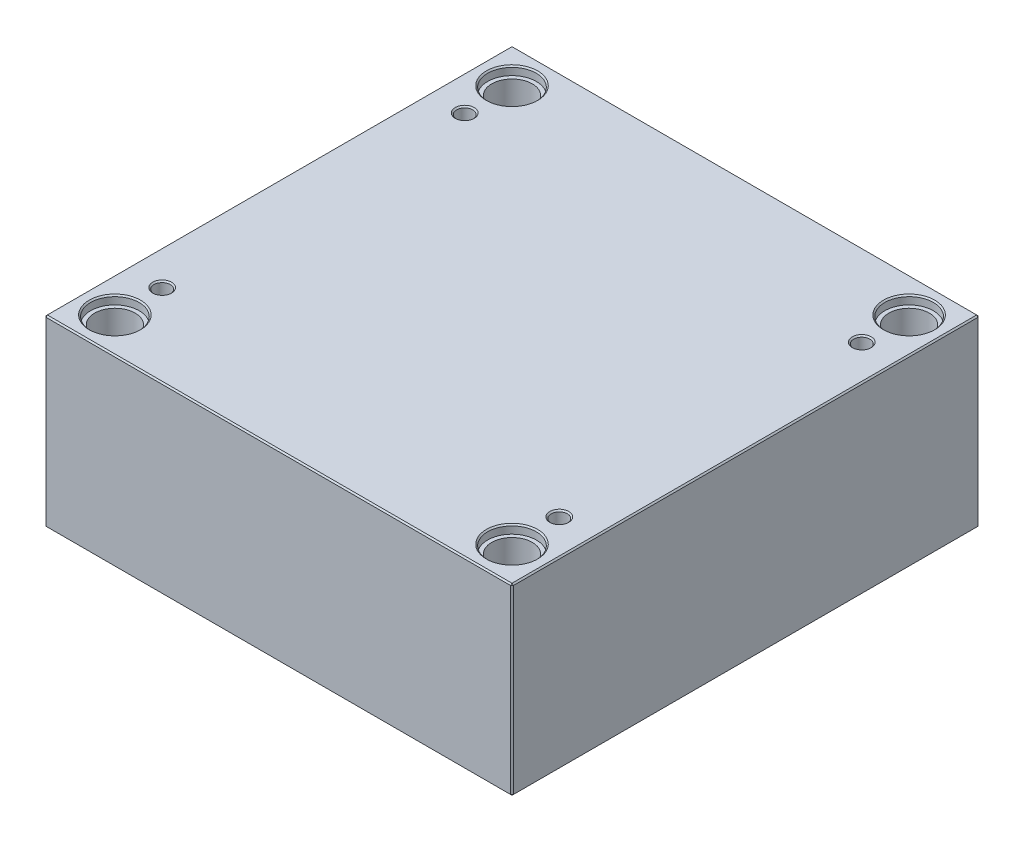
ISO-10303-21;
HEADER;
FILE_DESCRIPTION(('STEP AP214'),'2;1');
FILE_NAME('part.step','',(''),(''),'','','');
FILE_SCHEMA(('AUTOMOTIVE_DESIGN { 1 0 10303 214 1 1 1 1 }'));
ENDSEC;
DATA;
#1=APPLICATION_CONTEXT('core data for automotive mechanical design processes');
#2=APPLICATION_PROTOCOL_DEFINITION('international standard','automotive_design',2000,#1);
#3=PRODUCT_CONTEXT('',#1,'mechanical');
#4=PRODUCT('Part','Part','',(#3));
#5=PRODUCT_RELATED_PRODUCT_CATEGORY('part','',(#4));
#6=PRODUCT_DEFINITION_FORMATION('','',#4);
#7=PRODUCT_DEFINITION_CONTEXT('part definition',#1,'design');
#8=PRODUCT_DEFINITION('design','',#6,#7);
#9=PRODUCT_DEFINITION_SHAPE('','',#8);
#10=(LENGTH_UNIT() NAMED_UNIT(*) SI_UNIT(.MILLI.,.METRE.));
#11=(NAMED_UNIT(*) PLANE_ANGLE_UNIT() SI_UNIT($,.RADIAN.));
#12=(NAMED_UNIT(*) SI_UNIT($,.STERADIAN.) SOLID_ANGLE_UNIT());
#13=UNCERTAINTY_MEASURE_WITH_UNIT(LENGTH_MEASURE(1.E-05),#10,'distance_accuracy_value','');
#14=(GEOMETRIC_REPRESENTATION_CONTEXT(3) GLOBAL_UNCERTAINTY_ASSIGNED_CONTEXT((#13)) GLOBAL_UNIT_ASSIGNED_CONTEXT((#10,
#11,#12)) REPRESENTATION_CONTEXT('',''));
#15=CARTESIAN_POINT('',(0.,0.,0.));
#16=DIRECTION('',(0.,0.,1.));
#17=DIRECTION('',(1.,0.,0.));
#18=AXIS2_PLACEMENT_3D('',#15,#16,#17);
#19=CARTESIAN_POINT('',(-147.,0.,-147.));
#20=DIRECTION('',(0.,1.,0.));
#21=DIRECTION('',(0.,0.,1.));
#22=AXIS2_PLACEMENT_3D('',#19,#20,#21);
#23=CYLINDRICAL_SURFACE('',#22,15.);
#24=CARTESIAN_POINT('',(-147.,1.00000000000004,-147.));
#25=DIRECTION('',(0.,1.,0.));
#26=DIRECTION('',(0.,0.,1.));
#27=AXIS2_PLACEMENT_3D('',#24,#25,#26);
#28=CIRCLE('',#27,15.);
#29=CARTESIAN_POINT('',(-147.,1.00000000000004,-132.));
#30=VERTEX_POINT('',#29);
#31=EDGE_CURVE('E472',#30,#30,#28,.F.);
#32=ORIENTED_EDGE('',*,*,#31,.T.);
#33=EDGE_LOOP('',(#32));
#34=FACE_BOUND('',#33,.T.);
#35=CARTESIAN_POINT('',(-147.,129.7,-147.));
#36=DIRECTION('',(0.,1.,0.));
#37=DIRECTION('',(0.,0.,1.));
#38=AXIS2_PLACEMENT_3D('',#35,#36,#37);
#39=CIRCLE('',#38,15.);
#40=CARTESIAN_POINT('',(-147.,129.7,-132.));
#41=VERTEX_POINT('',#40);
#42=EDGE_CURVE('E221',#41,#41,#39,.F.);
#43=ORIENTED_EDGE('',*,*,#42,.F.);
#44=EDGE_LOOP('',(#43));
#45=FACE_BOUND('',#44,.T.);
#46=ADVANCED_FACE('F16',(#34,#45),#23,.F.);
#47=CARTESIAN_POINT('',(147.,0.,-147.));
#48=DIRECTION('',(0.,1.,0.));
#49=DIRECTION('',(0.,0.,1.));
#50=AXIS2_PLACEMENT_3D('',#47,#48,#49);
#51=CYLINDRICAL_SURFACE('',#50,15.);
#52=CARTESIAN_POINT('',(147.,1.00000000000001,-147.));
#53=DIRECTION('',(0.,1.,0.));
#54=DIRECTION('',(0.,0.,1.));
#55=AXIS2_PLACEMENT_3D('',#52,#53,#54);
#56=CIRCLE('',#55,15.);
#57=CARTESIAN_POINT('',(147.,1.00000000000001,-132.));
#58=VERTEX_POINT('',#57);
#59=EDGE_CURVE('E474',#58,#58,#56,.F.);
#60=ORIENTED_EDGE('',*,*,#59,.T.);
#61=EDGE_LOOP('',(#60));
#62=FACE_BOUND('',#61,.T.);
#63=CARTESIAN_POINT('',(147.,129.7,-147.));
#64=DIRECTION('',(0.,1.,0.));
#65=DIRECTION('',(0.,0.,1.));
#66=AXIS2_PLACEMENT_3D('',#63,#64,#65);
#67=CIRCLE('',#66,15.);
#68=CARTESIAN_POINT('',(147.,129.7,-132.));
#69=VERTEX_POINT('',#68);
#70=EDGE_CURVE('E218',#69,#69,#67,.F.);
#71=ORIENTED_EDGE('',*,*,#70,.F.);
#72=EDGE_LOOP('',(#71));
#73=FACE_BOUND('',#72,.T.);
#74=ADVANCED_FACE('F263',(#62,#73),#51,.F.);
#75=CARTESIAN_POINT('',(147.,0.,147.));
#76=DIRECTION('',(0.,1.,0.));
#77=DIRECTION('',(0.,0.,1.));
#78=AXIS2_PLACEMENT_3D('',#75,#76,#77);
#79=CYLINDRICAL_SURFACE('',#78,15.);
#80=CARTESIAN_POINT('',(147.,0.999999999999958,147.));
#81=DIRECTION('',(0.,1.,0.));
#82=DIRECTION('',(0.,0.,1.));
#83=AXIS2_PLACEMENT_3D('',#80,#81,#82);
#84=CIRCLE('',#83,15.);
#85=CARTESIAN_POINT('',(147.,0.999999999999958,162.));
#86=VERTEX_POINT('',#85);
#87=EDGE_CURVE('E477',#86,#86,#84,.F.);
#88=ORIENTED_EDGE('',*,*,#87,.T.);
#89=EDGE_LOOP('',(#88));
#90=FACE_BOUND('',#89,.T.);
#91=CARTESIAN_POINT('',(147.,129.7,147.));
#92=DIRECTION('',(0.,1.,0.));
#93=DIRECTION('',(0.,0.,1.));
#94=AXIS2_PLACEMENT_3D('',#91,#92,#93);
#95=CIRCLE('',#94,15.);
#96=CARTESIAN_POINT('',(147.,129.7,162.));
#97=VERTEX_POINT('',#96);
#98=EDGE_CURVE('E214',#97,#97,#95,.F.);
#99=ORIENTED_EDGE('',*,*,#98,.F.);
#100=EDGE_LOOP('',(#99));
#101=FACE_BOUND('',#100,.T.);
#102=ADVANCED_FACE('F270',(#90,#101),#79,.F.);
#103=CARTESIAN_POINT('',(-147.,0.,147.));
#104=DIRECTION('',(0.,1.,0.));
#105=DIRECTION('',(0.,0.,1.));
#106=AXIS2_PLACEMENT_3D('',#103,#104,#105);
#107=CYLINDRICAL_SURFACE('',#106,15.);
#108=CARTESIAN_POINT('',(-147.,1.00000000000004,147.));
#109=DIRECTION('',(0.,1.,0.));
#110=DIRECTION('',(0.,0.,1.));
#111=AXIS2_PLACEMENT_3D('',#108,#109,#110);
#112=CIRCLE('',#111,15.);
#113=CARTESIAN_POINT('',(-147.,1.00000000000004,162.));
#114=VERTEX_POINT('',#113);
#115=EDGE_CURVE('E480',#114,#114,#112,.F.);
#116=ORIENTED_EDGE('',*,*,#115,.T.);
#117=EDGE_LOOP('',(#116));
#118=FACE_BOUND('',#117,.T.);
#119=CARTESIAN_POINT('',(-147.,129.7,147.));
#120=DIRECTION('',(0.,1.,0.));
#121=DIRECTION('',(0.,0.,1.));
#122=AXIS2_PLACEMENT_3D('',#119,#120,#121);
#123=CIRCLE('',#122,15.);
#124=CARTESIAN_POINT('',(-147.,129.7,162.));
#125=VERTEX_POINT('',#124);
#126=EDGE_CURVE('E211',#125,#125,#123,.F.);
#127=ORIENTED_EDGE('',*,*,#126,.F.);
#128=EDGE_LOOP('',(#127));
#129=FACE_BOUND('',#128,.T.);
#130=ADVANCED_FACE('F277',(#118,#129),#107,.F.);
#131=CARTESIAN_POINT('',(-173.,136.,173.));
#132=DIRECTION('',(1.,0.,0.));
#133=DIRECTION('',(0.,0.,-1.));
#134=AXIS2_PLACEMENT_3D('',#131,#132,#133);
#135=PLANE('',#134);
#136=DIRECTION('',(0.,-1.,0.));
#137=VECTOR('',#136,1.);
#138=CARTESIAN_POINT('',(-173.,136.,-172.));
#139=LINE('',#138,#137);
#140=CARTESIAN_POINT('',(-173.,135.,-172.));
#141=VERTEX_POINT('',#140);
#142=CARTESIAN_POINT('',(-173.,1.,-172.));
#143=VERTEX_POINT('',#142);
#144=EDGE_CURVE('E487',#141,#143,#139,.T.);
#145=ORIENTED_EDGE('',*,*,#144,.T.);
#146=DIRECTION('',(0.,0.,1.));
#147=VECTOR('',#146,1.);
#148=CARTESIAN_POINT('',(-173.,1.,173.));
#149=LINE('',#148,#147);
#150=CARTESIAN_POINT('',(-173.,1.,172.));
#151=VERTEX_POINT('',#150);
#152=EDGE_CURVE('E490',#143,#151,#149,.T.);
#153=ORIENTED_EDGE('',*,*,#152,.T.);
#154=DIRECTION('',(0.,1.,0.));
#155=VECTOR('',#154,1.);
#156=CARTESIAN_POINT('',(-173.,136.,172.));
#157=LINE('',#156,#155);
#158=CARTESIAN_POINT('',(-173.,135.,172.));
#159=VERTEX_POINT('',#158);
#160=EDGE_CURVE('E485',#151,#159,#157,.T.);
#161=ORIENTED_EDGE('',*,*,#160,.T.);
#162=DIRECTION('',(0.,0.,-1.));
#163=VECTOR('',#162,1.);
#164=CARTESIAN_POINT('',(-173.,135.,-173.));
#165=LINE('',#164,#163);
#166=EDGE_CURVE('E483',#159,#141,#165,.T.);
#167=ORIENTED_EDGE('',*,*,#166,.T.);
#168=EDGE_LOOP('',(#145,#153,#161,#167));
#169=FACE_BOUND('',#168,.T.);
#170=ADVANCED_FACE('F298',(#169),#135,.F.);
#171=CARTESIAN_POINT('',(173.,136.,173.));
#172=DIRECTION('',(0.,0.,-1.));
#173=DIRECTION('',(-1.,0.,0.));
#174=AXIS2_PLACEMENT_3D('',#171,#172,#173);
#175=PLANE('',#174);
#176=DIRECTION('',(-1.,0.,0.));
#177=VECTOR('',#176,1.);
#178=CARTESIAN_POINT('',(-173.,135.,173.));
#179=LINE('',#178,#177);
#180=CARTESIAN_POINT('',(172.,135.,173.));
#181=VERTEX_POINT('',#180);
#182=CARTESIAN_POINT('',(-172.,135.,173.));
#183=VERTEX_POINT('',#182);
#184=EDGE_CURVE('E509',#181,#183,#179,.T.);
#185=ORIENTED_EDGE('',*,*,#184,.T.);
#186=DIRECTION('',(0.,-1.,0.));
#187=VECTOR('',#186,1.);
#188=CARTESIAN_POINT('',(-172.,136.,173.));
#189=LINE('',#188,#187);
#190=CARTESIAN_POINT('',(-172.,1.00000000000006,173.));
#191=VERTEX_POINT('',#190);
#192=EDGE_CURVE('E515',#183,#191,#189,.T.);
#193=ORIENTED_EDGE('',*,*,#192,.T.);
#194=DIRECTION('',(1.,0.,0.));
#195=VECTOR('',#194,1.);
#196=CARTESIAN_POINT('',(173.,1.00000000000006,173.));
#197=LINE('',#196,#195);
#198=CARTESIAN_POINT('',(172.,1.00000000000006,173.));
#199=VERTEX_POINT('',#198);
#200=EDGE_CURVE('E513',#191,#199,#197,.T.);
#201=ORIENTED_EDGE('',*,*,#200,.T.);
#202=DIRECTION('',(0.,1.,0.));
#203=VECTOR('',#202,1.);
#204=CARTESIAN_POINT('',(172.,136.,173.));
#205=LINE('',#204,#203);
#206=EDGE_CURVE('E511',#199,#181,#205,.T.);
#207=ORIENTED_EDGE('',*,*,#206,.T.);
#208=EDGE_LOOP('',(#185,#193,#201,#207));
#209=FACE_BOUND('',#208,.T.);
#210=ADVANCED_FACE('F294',(#209),#175,.F.);
#211=CARTESIAN_POINT('',(173.,136.,173.));
#212=DIRECTION('',(-1.,0.,0.));
#213=DIRECTION('',(0.,0.,1.));
#214=AXIS2_PLACEMENT_3D('',#211,#212,#213);
#215=PLANE('',#214);
#216=DIRECTION('',(0.,0.,-1.));
#217=VECTOR('',#216,1.);
#218=CARTESIAN_POINT('',(173.,1.00000000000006,173.));
#219=LINE('',#218,#217);
#220=CARTESIAN_POINT('',(173.,1.00000000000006,172.));
#221=VERTEX_POINT('',#220);
#222=CARTESIAN_POINT('',(173.,1.00000000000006,-172.));
#223=VERTEX_POINT('',#222);
#224=EDGE_CURVE('E504',#221,#223,#219,.T.);
#225=ORIENTED_EDGE('',*,*,#224,.T.);
#226=DIRECTION('',(0.,1.,0.));
#227=VECTOR('',#226,1.);
#228=CARTESIAN_POINT('',(173.,136.,-172.));
#229=LINE('',#228,#227);
#230=CARTESIAN_POINT('',(173.,135.,-172.));
#231=VERTEX_POINT('',#230);
#232=EDGE_CURVE('E506',#223,#231,#229,.T.);
#233=ORIENTED_EDGE('',*,*,#232,.T.);
#234=DIRECTION('',(0.,0.,1.));
#235=VECTOR('',#234,1.);
#236=CARTESIAN_POINT('',(173.,135.,173.));
#237=LINE('',#236,#235);
#238=CARTESIAN_POINT('',(173.,135.,172.));
#239=VERTEX_POINT('',#238);
#240=EDGE_CURVE('E500',#231,#239,#237,.T.);
#241=ORIENTED_EDGE('',*,*,#240,.T.);
#242=DIRECTION('',(0.,-1.,0.));
#243=VECTOR('',#242,1.);
#244=CARTESIAN_POINT('',(173.,136.,172.));
#245=LINE('',#244,#243);
#246=EDGE_CURVE('E502',#239,#221,#245,.T.);
#247=ORIENTED_EDGE('',*,*,#246,.T.);
#248=EDGE_LOOP('',(#225,#233,#241,#247));
#249=FACE_BOUND('',#248,.T.);
#250=ADVANCED_FACE('F290',(#249),#215,.F.);
#251=CARTESIAN_POINT('',(173.,136.,-173.));
#252=DIRECTION('',(0.,0.,1.));
#253=DIRECTION('',(1.,0.,0.));
#254=AXIS2_PLACEMENT_3D('',#251,#252,#253);
#255=PLANE('',#254);
#256=DIRECTION('',(0.,-1.,0.));
#257=VECTOR('',#256,1.);
#258=CARTESIAN_POINT('',(172.,136.,-173.));
#259=LINE('',#258,#257);
#260=CARTESIAN_POINT('',(172.,135.,-173.));
#261=VERTEX_POINT('',#260);
#262=CARTESIAN_POINT('',(172.,1.00000000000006,-173.));
#263=VERTEX_POINT('',#262);
#264=EDGE_CURVE('E494',#261,#263,#259,.T.);
#265=ORIENTED_EDGE('',*,*,#264,.T.);
#266=DIRECTION('',(-1.,0.,0.));
#267=VECTOR('',#266,1.);
#268=CARTESIAN_POINT('',(173.,1.00000000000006,-173.));
#269=LINE('',#268,#267);
#270=CARTESIAN_POINT('',(-172.,1.00000000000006,-173.));
#271=VERTEX_POINT('',#270);
#272=EDGE_CURVE('E138',#263,#271,#269,.T.);
#273=ORIENTED_EDGE('',*,*,#272,.T.);
#274=DIRECTION('',(0.,1.,0.));
#275=VECTOR('',#274,1.);
#276=CARTESIAN_POINT('',(-172.,136.,-173.));
#277=LINE('',#276,#275);
#278=CARTESIAN_POINT('',(-172.,135.,-173.));
#279=VERTEX_POINT('',#278);
#280=EDGE_CURVE('E496',#271,#279,#277,.T.);
#281=ORIENTED_EDGE('',*,*,#280,.T.);
#282=DIRECTION('',(1.,0.,0.));
#283=VECTOR('',#282,1.);
#284=CARTESIAN_POINT('',(173.,135.,-173.));
#285=LINE('',#284,#283);
#286=EDGE_CURVE('E492',#279,#261,#285,.T.);
#287=ORIENTED_EDGE('',*,*,#286,.T.);
#288=EDGE_LOOP('',(#265,#273,#281,#287));
#289=FACE_BOUND('',#288,.T.);
#290=ADVANCED_FACE('F282',(#289),#255,.F.);
#291=CARTESIAN_POINT('',(0.,136.,0.));
#292=DIRECTION('',(0.,1.,0.));
#293=DIRECTION('',(0.,0.,1.));
#294=AXIS2_PLACEMENT_3D('',#291,#292,#293);
#295=PLANE('',#294);
#296=CARTESIAN_POINT('',(147.,136.,147.));
#297=DIRECTION('',(0.,1.,0.));
#298=DIRECTION('',(0.,0.,1.));
#299=AXIS2_PLACEMENT_3D('',#296,#297,#298);
#300=CIRCLE('',#299,19.);
#301=CARTESIAN_POINT('',(147.,136.,166.));
#302=VERTEX_POINT('',#301);
#303=EDGE_CURVE('E236',#302,#302,#300,.F.);
#304=ORIENTED_EDGE('',*,*,#303,.T.);
#305=EDGE_LOOP('',(#304));
#306=FACE_BOUND('',#305,.T.);
#307=CARTESIAN_POINT('',(-147.,136.,147.));
#308=DIRECTION('',(0.,1.,0.));
#309=DIRECTION('',(0.,0.,1.));
#310=AXIS2_PLACEMENT_3D('',#307,#308,#309);
#311=CIRCLE('',#310,19.);
#312=CARTESIAN_POINT('',(-147.,136.,166.));
#313=VERTEX_POINT('',#312);
#314=EDGE_CURVE('E233',#313,#313,#311,.F.);
#315=ORIENTED_EDGE('',*,*,#314,.T.);
#316=EDGE_LOOP('',(#315));
#317=FACE_BOUND('',#316,.T.);
#318=CARTESIAN_POINT('',(147.,136.,-147.));
#319=DIRECTION('',(0.,1.,0.));
#320=DIRECTION('',(0.,0.,1.));
#321=AXIS2_PLACEMENT_3D('',#318,#319,#320);
#322=CIRCLE('',#321,19.);
#323=CARTESIAN_POINT('',(147.,136.,-128.));
#324=VERTEX_POINT('',#323);
#325=EDGE_CURVE('E230',#324,#324,#322,.F.);
#326=ORIENTED_EDGE('',*,*,#325,.T.);
#327=EDGE_LOOP('',(#326));
#328=FACE_BOUND('',#327,.T.);
#329=CARTESIAN_POINT('',(-147.,136.,-147.));
#330=DIRECTION('',(0.,1.,0.));
#331=DIRECTION('',(0.,0.,1.));
#332=AXIS2_PLACEMENT_3D('',#329,#330,#331);
#333=CIRCLE('',#332,19.);
#334=CARTESIAN_POINT('',(-147.,136.,-128.));
#335=VERTEX_POINT('',#334);
#336=EDGE_CURVE('E227',#335,#335,#333,.F.);
#337=ORIENTED_EDGE('',*,*,#336,.T.);
#338=EDGE_LOOP('',(#337));
#339=FACE_BOUND('',#338,.T.);
#340=CARTESIAN_POINT('',(-147.,136.,112.));
#341=DIRECTION('',(0.,1.,0.));
#342=DIRECTION('',(0.,0.,1.));
#343=AXIS2_PLACEMENT_3D('',#340,#341,#342);
#344=CIRCLE('',#343,7.);
#345=CARTESIAN_POINT('',(-147.,136.,119.));
#346=VERTEX_POINT('',#345);
#347=EDGE_CURVE('E198',#346,#346,#344,.F.);
#348=ORIENTED_EDGE('',*,*,#347,.T.);
#349=EDGE_LOOP('',(#348));
#350=FACE_BOUND('',#349,.T.);
#351=CARTESIAN_POINT('',(147.,136.,112.));
#352=DIRECTION('',(0.,1.,0.));
#353=DIRECTION('',(0.,0.,1.));
#354=AXIS2_PLACEMENT_3D('',#351,#352,#353);
#355=CIRCLE('',#354,7.);
#356=CARTESIAN_POINT('',(147.,136.,119.));
#357=VERTEX_POINT('',#356);
#358=EDGE_CURVE('E195',#357,#357,#355,.F.);
#359=ORIENTED_EDGE('',*,*,#358,.T.);
#360=EDGE_LOOP('',(#359));
#361=FACE_BOUND('',#360,.T.);
#362=CARTESIAN_POINT('',(147.,136.,-112.));
#363=DIRECTION('',(0.,1.,0.));
#364=DIRECTION('',(0.,0.,1.));
#365=AXIS2_PLACEMENT_3D('',#362,#363,#364);
#366=CIRCLE('',#365,7.);
#367=CARTESIAN_POINT('',(147.,136.,-105.));
#368=VERTEX_POINT('',#367);
#369=EDGE_CURVE('E192',#368,#368,#366,.F.);
#370=ORIENTED_EDGE('',*,*,#369,.T.);
#371=EDGE_LOOP('',(#370));
#372=FACE_BOUND('',#371,.T.);
#373=CARTESIAN_POINT('',(-147.,136.,-112.));
#374=DIRECTION('',(0.,1.,0.));
#375=DIRECTION('',(0.,0.,1.));
#376=AXIS2_PLACEMENT_3D('',#373,#374,#375);
#377=CIRCLE('',#376,7.);
#378=CARTESIAN_POINT('',(-147.,136.,-105.));
#379=VERTEX_POINT('',#378);
#380=EDGE_CURVE('E188',#379,#379,#377,.F.);
#381=ORIENTED_EDGE('',*,*,#380,.T.);
#382=EDGE_LOOP('',(#381));
#383=FACE_BOUND('',#382,.T.);
#384=DIRECTION('',(0.,0.,-1.));
#385=VECTOR('',#384,1.);
#386=CARTESIAN_POINT('',(172.,136.,-173.));
#387=LINE('',#386,#385);
#388=CARTESIAN_POINT('',(172.,136.,172.));
#389=VERTEX_POINT('',#388);
#390=CARTESIAN_POINT('',(172.,136.,-172.));
#391=VERTEX_POINT('',#390);
#392=EDGE_CURVE('E31',#389,#391,#387,.T.);
#393=ORIENTED_EDGE('',*,*,#392,.T.);
#394=DIRECTION('',(-1.,0.,0.));
#395=VECTOR('',#394,1.);
#396=CARTESIAN_POINT('',(-173.,136.,-172.));
#397=LINE('',#396,#395);
#398=CARTESIAN_POINT('',(-172.,136.,-172.));
#399=VERTEX_POINT('',#398);
#400=EDGE_CURVE('E189',#391,#399,#397,.T.);
#401=ORIENTED_EDGE('',*,*,#400,.T.);
#402=DIRECTION('',(0.,0.,1.));
#403=VECTOR('',#402,1.);
#404=CARTESIAN_POINT('',(-172.,136.,173.));
#405=LINE('',#404,#403);
#406=CARTESIAN_POINT('',(-172.,136.,172.));
#407=VERTEX_POINT('',#406);
#408=EDGE_CURVE('E518',#399,#407,#405,.T.);
#409=ORIENTED_EDGE('',*,*,#408,.T.);
#410=DIRECTION('',(1.,0.,0.));
#411=VECTOR('',#410,1.);
#412=CARTESIAN_POINT('',(173.,136.,172.));
#413=LINE('',#412,#411);
#414=EDGE_CURVE('E36',#407,#389,#413,.T.);
#415=ORIENTED_EDGE('',*,*,#414,.T.);
#416=EDGE_LOOP('',(#393,#401,#409,#415));
#417=FACE_BOUND('',#416,.T.);
#418=ADVANCED_FACE('F279',(#306,#317,#328,#339,#350,#361,#372,#383,#417),#295,.T.);
#419=CARTESIAN_POINT('',(0.,0.,0.));
#420=DIRECTION('',(0.,1.,0.));
#421=DIRECTION('',(0.,0.,1.));
#422=AXIS2_PLACEMENT_3D('',#419,#420,#421);
#423=PLANE('',#422);
#424=CARTESIAN_POINT('',(-147.,0.,-147.));
#425=DIRECTION('',(0.,1.,0.));
#426=DIRECTION('',(0.,0.,1.));
#427=AXIS2_PLACEMENT_3D('',#424,#425,#426);
#428=CIRCLE('',#427,16.);
#429=CARTESIAN_POINT('',(-147.,0.,-131.));
#430=VERTEX_POINT('',#429);
#431=EDGE_CURVE('E469',#430,#430,#428,.T.);
#432=ORIENTED_EDGE('',*,*,#431,.T.);
#433=EDGE_LOOP('',(#432));
#434=FACE_BOUND('',#433,.T.);
#435=CARTESIAN_POINT('',(147.,0.,-147.));
#436=DIRECTION('',(0.,1.,0.));
#437=DIRECTION('',(0.,0.,1.));
#438=AXIS2_PLACEMENT_3D('',#435,#436,#437);
#439=CIRCLE('',#438,16.);
#440=CARTESIAN_POINT('',(147.,0.,-131.));
#441=VERTEX_POINT('',#440);
#442=EDGE_CURVE('E466',#441,#441,#439,.T.);
#443=ORIENTED_EDGE('',*,*,#442,.T.);
#444=EDGE_LOOP('',(#443));
#445=FACE_BOUND('',#444,.T.);
#446=CARTESIAN_POINT('',(147.,0.,147.));
#447=DIRECTION('',(0.,1.,0.));
#448=DIRECTION('',(0.,0.,1.));
#449=AXIS2_PLACEMENT_3D('',#446,#447,#448);
#450=CIRCLE('',#449,16.);
#451=CARTESIAN_POINT('',(147.,0.,163.));
#452=VERTEX_POINT('',#451);
#453=EDGE_CURVE('E463',#452,#452,#450,.T.);
#454=ORIENTED_EDGE('',*,*,#453,.T.);
#455=EDGE_LOOP('',(#454));
#456=FACE_BOUND('',#455,.T.);
#457=CARTESIAN_POINT('',(-147.,0.,147.));
#458=DIRECTION('',(0.,1.,0.));
#459=DIRECTION('',(0.,0.,1.));
#460=AXIS2_PLACEMENT_3D('',#457,#458,#459);
#461=CIRCLE('',#460,16.);
#462=CARTESIAN_POINT('',(-147.,0.,163.));
#463=VERTEX_POINT('',#462);
#464=EDGE_CURVE('E460',#463,#463,#461,.T.);
#465=ORIENTED_EDGE('',*,*,#464,.T.);
#466=EDGE_LOOP('',(#465));
#467=FACE_BOUND('',#466,.T.);
#468=DIRECTION('',(0.,0.,1.));
#469=VECTOR('',#468,1.);
#470=CARTESIAN_POINT('',(172.,0.,0.));
#471=LINE('',#470,#469);
#472=CARTESIAN_POINT('',(172.,0.,-172.));
#473=VERTEX_POINT('',#472);
#474=CARTESIAN_POINT('',(172.,0.,172.));
#475=VERTEX_POINT('',#474);
#476=EDGE_CURVE('E108',#473,#475,#471,.T.);
#477=ORIENTED_EDGE('',*,*,#476,.T.);
#478=DIRECTION('',(-1.,0.,0.));
#479=VECTOR('',#478,1.);
#480=CARTESIAN_POINT('',(0.,0.,172.));
#481=LINE('',#480,#479);
#482=CARTESIAN_POINT('',(-172.,0.,172.));
#483=VERTEX_POINT('',#482);
#484=EDGE_CURVE('E458',#475,#483,#481,.T.);
#485=ORIENTED_EDGE('',*,*,#484,.T.);
#486=DIRECTION('',(0.,0.,-1.));
#487=VECTOR('',#486,1.);
#488=CARTESIAN_POINT('',(-172.,0.,0.));
#489=LINE('',#488,#487);
#490=CARTESIAN_POINT('',(-172.,0.,-172.));
#491=VERTEX_POINT('',#490);
#492=EDGE_CURVE('E110',#483,#491,#489,.T.);
#493=ORIENTED_EDGE('',*,*,#492,.T.);
#494=DIRECTION('',(1.,0.,0.));
#495=VECTOR('',#494,1.);
#496=CARTESIAN_POINT('',(0.,0.,-172.));
#497=LINE('',#496,#495);
#498=EDGE_CURVE('E104',#491,#473,#497,.T.);
#499=ORIENTED_EDGE('',*,*,#498,.T.);
#500=EDGE_LOOP('',(#477,#485,#493,#499));
#501=FACE_BOUND('',#500,.T.);
#502=ADVANCED_FACE('F106',(#434,#445,#456,#467,#501),#423,.F.);
#503=CARTESIAN_POINT('',(-147.,0.,-147.));
#504=DIRECTION('',(0.,-1.,0.));
#505=DIRECTION('',(0.,0.,-1.));
#506=AXIS2_PLACEMENT_3D('',#503,#504,#505);
#507=CONICAL_SURFACE('',#506,16.,0.785398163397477);
#508=ORIENTED_EDGE('',*,*,#31,.F.);
#509=EDGE_LOOP('',(#508));
#510=FACE_BOUND('',#509,.T.);
#511=ORIENTED_EDGE('',*,*,#431,.F.);
#512=EDGE_LOOP('',(#511));
#513=FACE_BOUND('',#512,.T.);
#514=ADVANCED_FACE('F286',(#510,#513),#507,.F.);
#515=CARTESIAN_POINT('',(147.,0.,-147.));
#516=DIRECTION('',(0.,-1.,0.));
#517=DIRECTION('',(0.,0.,-1.));
#518=AXIS2_PLACEMENT_3D('',#515,#516,#517);
#519=CONICAL_SURFACE('',#518,16.,0.785398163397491);
#520=ORIENTED_EDGE('',*,*,#59,.F.);
#521=EDGE_LOOP('',(#520));
#522=FACE_BOUND('',#521,.T.);
#523=ORIENTED_EDGE('',*,*,#442,.F.);
#524=EDGE_LOOP('',(#523));
#525=FACE_BOUND('',#524,.T.);
#526=ADVANCED_FACE('F305',(#522,#525),#519,.F.);
#527=CARTESIAN_POINT('',(147.,0.,147.));
#528=DIRECTION('',(0.,-1.,0.));
#529=DIRECTION('',(0.,0.,-1.));
#530=AXIS2_PLACEMENT_3D('',#527,#528,#529);
#531=CONICAL_SURFACE('',#530,16.,0.78539816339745);
#532=ORIENTED_EDGE('',*,*,#87,.F.);
#533=EDGE_LOOP('',(#532));
#534=FACE_BOUND('',#533,.T.);
#535=ORIENTED_EDGE('',*,*,#453,.F.);
#536=EDGE_LOOP('',(#535));
#537=FACE_BOUND('',#536,.T.);
#538=ADVANCED_FACE('F309',(#534,#537),#531,.F.);
#539=CARTESIAN_POINT('',(-147.,0.,147.));
#540=DIRECTION('',(0.,-1.,0.));
#541=DIRECTION('',(0.,0.,-1.));
#542=AXIS2_PLACEMENT_3D('',#539,#540,#541);
#543=CONICAL_SURFACE('',#542,16.,0.785398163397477);
#544=ORIENTED_EDGE('',*,*,#115,.F.);
#545=EDGE_LOOP('',(#544));
#546=FACE_BOUND('',#545,.T.);
#547=ORIENTED_EDGE('',*,*,#464,.F.);
#548=EDGE_LOOP('',(#547));
#549=FACE_BOUND('',#548,.T.);
#550=ADVANCED_FACE('F313',(#546,#549),#543,.F.);
#551=CARTESIAN_POINT('',(173.,136.,172.));
#552=DIRECTION('',(-0.707106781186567,0.,-0.707106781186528));
#553=DIRECTION('',(0.,-1.,0.));
#554=AXIS2_PLACEMENT_3D('',#551,#552,#553);
#555=PLANE('',#554);
#556=DIRECTION('',(-0.707106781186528,0.,0.707106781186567));
#557=VECTOR('',#556,1.);
#558=CARTESIAN_POINT('',(172.,135.,173.));
#559=LINE('',#558,#557);
#560=EDGE_CURVE('E126',#181,#239,#559,.F.);
#561=ORIENTED_EDGE('',*,*,#560,.F.);
#562=ORIENTED_EDGE('',*,*,#206,.F.);
#563=DIRECTION('',(0.707106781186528,0.,-0.707106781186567));
#564=VECTOR('',#563,1.);
#565=CARTESIAN_POINT('',(172.,1.00000000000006,173.));
#566=LINE('',#565,#564);
#567=EDGE_CURVE('E180',#221,#199,#566,.F.);
#568=ORIENTED_EDGE('',*,*,#567,.F.);
#569=ORIENTED_EDGE('',*,*,#246,.F.);
#570=EDGE_LOOP('',(#561,#562,#568,#569));
#571=FACE_BOUND('',#570,.T.);
#572=ADVANCED_FACE('F317',(#571),#555,.F.);
#573=CARTESIAN_POINT('',(172.,135.,173.));
#574=DIRECTION('',(0.57735026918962,0.577350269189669,0.577350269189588));
#575=DIRECTION('',(-0.707106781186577,0.707106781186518,0.));
#576=AXIS2_PLACEMENT_3D('',#573,#574,#575);
#577=PLANE('',#576);
#578=DIRECTION('',(0.,-0.707106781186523,0.707106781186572));
#579=VECTOR('',#578,1.);
#580=CARTESIAN_POINT('',(172.,135.,173.));
#581=LINE('',#580,#579);
#582=EDGE_CURVE('E175',#181,#389,#581,.F.);
#583=ORIENTED_EDGE('',*,*,#582,.F.);
#584=ORIENTED_EDGE('',*,*,#560,.T.);
#585=DIRECTION('',(-0.707106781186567,0.707106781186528,0.));
#586=VECTOR('',#585,1.);
#587=CARTESIAN_POINT('',(172.5,135.5,172.));
#588=LINE('',#587,#586);
#589=EDGE_CURVE('E177',#389,#239,#588,.F.);
#590=ORIENTED_EDGE('',*,*,#589,.F.);
#591=EDGE_LOOP('',(#583,#584,#590));
#592=FACE_BOUND('',#591,.T.);
#593=ADVANCED_FACE('F385',(#592),#577,.T.);
#594=CARTESIAN_POINT('',(172.,1.00000000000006,173.));
#595=DIRECTION('',(0.577350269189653,-0.577350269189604,0.57735026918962));
#596=DIRECTION('',(0.707106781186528,0.,-0.707106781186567));
#597=AXIS2_PLACEMENT_3D('',#594,#595,#596);
#598=PLANE('',#597);
#599=DIRECTION('',(-0.707106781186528,-0.707106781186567,0.));
#600=VECTOR('',#599,1.);
#601=CARTESIAN_POINT('',(172.5,0.500000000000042,172.));
#602=LINE('',#601,#600);
#603=EDGE_CURVE('E124',#221,#475,#602,.T.);
#604=ORIENTED_EDGE('',*,*,#603,.F.);
#605=ORIENTED_EDGE('',*,*,#567,.T.);
#606=DIRECTION('',(0.,0.707106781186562,0.707106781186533));
#607=VECTOR('',#606,1.);
#608=CARTESIAN_POINT('',(172.,1.00000000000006,173.));
#609=LINE('',#608,#607);
#610=EDGE_CURVE('E172',#475,#199,#609,.T.);
#611=ORIENTED_EDGE('',*,*,#610,.F.);
#612=EDGE_LOOP('',(#604,#605,#611));
#613=FACE_BOUND('',#612,.T.);
#614=ADVANCED_FACE('F381',(#613),#598,.T.);
#615=CARTESIAN_POINT('',(172.,136.,0.));
#616=DIRECTION('',(0.707106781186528,0.707106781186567,0.));
#617=DIRECTION('',(0.,0.,1.));
#618=AXIS2_PLACEMENT_3D('',#615,#616,#617);
#619=PLANE('',#618);
#620=ORIENTED_EDGE('',*,*,#589,.T.);
#621=ORIENTED_EDGE('',*,*,#240,.F.);
#622=DIRECTION('',(0.707106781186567,-0.707106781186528,0.));
#623=VECTOR('',#622,1.);
#624=CARTESIAN_POINT('',(173.,135.,-172.));
#625=LINE('',#624,#623);
#626=EDGE_CURVE('E166',#391,#231,#625,.T.);
#627=ORIENTED_EDGE('',*,*,#626,.F.);
#628=ORIENTED_EDGE('',*,*,#392,.F.);
#629=EDGE_LOOP('',(#620,#621,#627,#628));
#630=FACE_BOUND('',#629,.T.);
#631=ADVANCED_FACE('F377',(#630),#619,.T.);
#632=CARTESIAN_POINT('',(0.,136.,172.));
#633=DIRECTION('',(0.,0.707106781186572,0.707106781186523));
#634=DIRECTION('',(-1.,0.,0.));
#635=AXIS2_PLACEMENT_3D('',#632,#633,#634);
#636=PLANE('',#635);
#637=ORIENTED_EDGE('',*,*,#582,.T.);
#638=ORIENTED_EDGE('',*,*,#414,.F.);
#639=DIRECTION('',(0.,0.707106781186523,-0.707106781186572));
#640=VECTOR('',#639,1.);
#641=CARTESIAN_POINT('',(-172.,135.5,172.5));
#642=LINE('',#641,#640);
#643=EDGE_CURVE('E163',#183,#407,#642,.T.);
#644=ORIENTED_EDGE('',*,*,#643,.F.);
#645=ORIENTED_EDGE('',*,*,#184,.F.);
#646=EDGE_LOOP('',(#637,#638,#644,#645));
#647=FACE_BOUND('',#646,.T.);
#648=ADVANCED_FACE('F373',(#647),#636,.T.);
#649=CARTESIAN_POINT('',(-172.,136.,173.));
#650=DIRECTION('',(0.707106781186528,0.,-0.707106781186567));
#651=DIRECTION('',(0.,-1.,0.));
#652=AXIS2_PLACEMENT_3D('',#649,#650,#651);
#653=PLANE('',#652);
#654=DIRECTION('',(0.707106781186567,0.,0.707106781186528));
#655=VECTOR('',#654,1.);
#656=CARTESIAN_POINT('',(-172.,1.00000000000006,173.));
#657=LINE('',#656,#655);
#658=EDGE_CURVE('E157',#191,#151,#657,.F.);
#659=ORIENTED_EDGE('',*,*,#658,.F.);
#660=ORIENTED_EDGE('',*,*,#192,.F.);
#661=DIRECTION('',(-0.707106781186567,0.,-0.707106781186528));
#662=VECTOR('',#661,1.);
#663=CARTESIAN_POINT('',(-173.,135.,172.));
#664=LINE('',#663,#662);
#665=EDGE_CURVE('E160',#159,#183,#664,.F.);
#666=ORIENTED_EDGE('',*,*,#665,.F.);
#667=ORIENTED_EDGE('',*,*,#160,.F.);
#668=EDGE_LOOP('',(#659,#660,#666,#667));
#669=FACE_BOUND('',#668,.T.);
#670=ADVANCED_FACE('F369',(#669),#653,.F.);
#671=CARTESIAN_POINT('',(173.,1.00000000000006,173.));
#672=DIRECTION('',(0.,0.707106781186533,-0.707106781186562));
#673=DIRECTION('',(1.,0.,0.));
#674=AXIS2_PLACEMENT_3D('',#671,#672,#673);
#675=PLANE('',#674);
#676=ORIENTED_EDGE('',*,*,#610,.T.);
#677=ORIENTED_EDGE('',*,*,#200,.F.);
#678=DIRECTION('',(0.,-0.707106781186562,-0.707106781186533));
#679=VECTOR('',#678,1.);
#680=CARTESIAN_POINT('',(-172.,1.00000000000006,173.));
#681=LINE('',#680,#679);
#682=EDGE_CURVE('E135',#483,#191,#681,.F.);
#683=ORIENTED_EDGE('',*,*,#682,.F.);
#684=ORIENTED_EDGE('',*,*,#484,.F.);
#685=EDGE_LOOP('',(#676,#677,#683,#684));
#686=FACE_BOUND('',#685,.T.);
#687=ADVANCED_FACE('F366',(#686),#675,.F.);
#688=CARTESIAN_POINT('',(173.,1.00000000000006,173.));
#689=DIRECTION('',(-0.707106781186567,0.707106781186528,0.));
#690=DIRECTION('',(0.,0.,-1.));
#691=AXIS2_PLACEMENT_3D('',#688,#689,#690);
#692=PLANE('',#691);
#693=ORIENTED_EDGE('',*,*,#603,.T.);
#694=ORIENTED_EDGE('',*,*,#476,.F.);
#695=DIRECTION('',(0.707106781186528,0.707106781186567,0.));
#696=VECTOR('',#695,1.);
#697=CARTESIAN_POINT('',(172.5,0.500000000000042,-172.));
#698=LINE('',#697,#696);
#699=EDGE_CURVE('E121',#223,#473,#698,.F.);
#700=ORIENTED_EDGE('',*,*,#699,.F.);
#701=ORIENTED_EDGE('',*,*,#224,.F.);
#702=EDGE_LOOP('',(#693,#694,#700,#701));
#703=FACE_BOUND('',#702,.T.);
#704=ADVANCED_FACE('F119',(#703),#692,.F.);
#705=CARTESIAN_POINT('',(172.,136.,-173.));
#706=DIRECTION('',(-0.707106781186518,0.,0.707106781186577));
#707=DIRECTION('',(0.,-1.,0.));
#708=AXIS2_PLACEMENT_3D('',#705,#706,#707);
#709=PLANE('',#708);
#710=DIRECTION('',(0.707106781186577,0.,0.707106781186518));
#711=VECTOR('',#710,1.);
#712=CARTESIAN_POINT('',(173.,135.,-172.));
#713=LINE('',#712,#711);
#714=EDGE_CURVE('E168',#231,#261,#713,.F.);
#715=ORIENTED_EDGE('',*,*,#714,.F.);
#716=ORIENTED_EDGE('',*,*,#232,.F.);
#717=DIRECTION('',(-0.707106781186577,0.,-0.707106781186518));
#718=VECTOR('',#717,1.);
#719=CARTESIAN_POINT('',(172.,1.00000000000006,-173.));
#720=LINE('',#719,#718);
#721=EDGE_CURVE('E134',#263,#223,#720,.F.);
#722=ORIENTED_EDGE('',*,*,#721,.F.);
#723=ORIENTED_EDGE('',*,*,#264,.F.);
#724=EDGE_LOOP('',(#715,#716,#722,#723));
#725=FACE_BOUND('',#724,.T.);
#726=ADVANCED_FACE('F359',(#725),#709,.F.);
#727=CARTESIAN_POINT('',(173.,135.,-172.));
#728=DIRECTION('',(0.577350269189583,0.577350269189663,-0.577350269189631));
#729=DIRECTION('',(0.,0.707106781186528,0.707106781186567));
#730=AXIS2_PLACEMENT_3D('',#727,#728,#729);
#731=PLANE('',#730);
#732=ORIENTED_EDGE('',*,*,#626,.T.);
#733=ORIENTED_EDGE('',*,*,#714,.T.);
#734=DIRECTION('',(0.,0.707106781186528,0.707106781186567));
#735=VECTOR('',#734,1.);
#736=CARTESIAN_POINT('',(172.,135.5,-172.5));
#737=LINE('',#736,#735);
#738=EDGE_CURVE('E152',#391,#261,#737,.F.);
#739=ORIENTED_EDGE('',*,*,#738,.F.);
#740=EDGE_LOOP('',(#732,#733,#739));
#741=FACE_BOUND('',#740,.T.);
#742=ADVANCED_FACE('F355',(#741),#731,.T.);
#743=CARTESIAN_POINT('',(-173.,135.,172.));
#744=DIRECTION('',(-0.577350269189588,0.577350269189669,0.57735026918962));
#745=DIRECTION('',(0.,-0.707106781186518,0.707106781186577));
#746=AXIS2_PLACEMENT_3D('',#743,#744,#745);
#747=PLANE('',#746);
#748=ORIENTED_EDGE('',*,*,#665,.T.);
#749=ORIENTED_EDGE('',*,*,#643,.T.);
#750=DIRECTION('',(-0.707106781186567,-0.707106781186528,0.));
#751=VECTOR('',#750,1.);
#752=CARTESIAN_POINT('',(-173.,135.,172.));
#753=LINE('',#752,#751);
#754=EDGE_CURVE('E143',#159,#407,#753,.F.);
#755=ORIENTED_EDGE('',*,*,#754,.F.);
#756=EDGE_LOOP('',(#748,#749,#755));
#757=FACE_BOUND('',#756,.T.);
#758=ADVANCED_FACE('F351',(#757),#747,.T.);
#759=CARTESIAN_POINT('',(-172.,1.00000000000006,173.));
#760=DIRECTION('',(-0.577350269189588,-0.577350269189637,0.577350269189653));
#761=DIRECTION('',(0.,-0.707106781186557,-0.707106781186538));
#762=AXIS2_PLACEMENT_3D('',#759,#760,#761);
#763=PLANE('',#762);
#764=ORIENTED_EDGE('',*,*,#682,.T.);
#765=ORIENTED_EDGE('',*,*,#658,.T.);
#766=DIRECTION('',(-0.707106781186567,0.707106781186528,0.));
#767=VECTOR('',#766,1.);
#768=CARTESIAN_POINT('',(-172.5,0.500000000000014,172.));
#769=LINE('',#768,#767);
#770=EDGE_CURVE('E139',#483,#151,#769,.T.);
#771=ORIENTED_EDGE('',*,*,#770,.F.);
#772=EDGE_LOOP('',(#764,#765,#771));
#773=FACE_BOUND('',#772,.T.);
#774=ADVANCED_FACE('F348',(#773),#763,.T.);
#775=CARTESIAN_POINT('',(172.,1.00000000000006,-173.));
#776=DIRECTION('',(0.577350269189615,-0.577350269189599,-0.577350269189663));
#777=DIRECTION('',(-0.707106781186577,0.,-0.707106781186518));
#778=AXIS2_PLACEMENT_3D('',#775,#776,#777);
#779=PLANE('',#778);
#780=ORIENTED_EDGE('',*,*,#721,.T.);
#781=ORIENTED_EDGE('',*,*,#699,.T.);
#782=DIRECTION('',(0.,-0.707106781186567,0.707106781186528));
#783=VECTOR('',#782,1.);
#784=CARTESIAN_POINT('',(172.,1.00000000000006,-173.));
#785=LINE('',#784,#783);
#786=EDGE_CURVE('E131',#263,#473,#785,.T.);
#787=ORIENTED_EDGE('',*,*,#786,.F.);
#788=EDGE_LOOP('',(#780,#781,#787));
#789=FACE_BOUND('',#788,.T.);
#790=ADVANCED_FACE('F130',(#789),#779,.T.);
#791=CARTESIAN_POINT('',(0.,136.,-172.));
#792=DIRECTION('',(0.,0.707106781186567,-0.707106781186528));
#793=DIRECTION('',(1.,0.,0.));
#794=AXIS2_PLACEMENT_3D('',#791,#792,#793);
#795=PLANE('',#794);
#796=ORIENTED_EDGE('',*,*,#738,.T.);
#797=ORIENTED_EDGE('',*,*,#286,.F.);
#798=DIRECTION('',(0.,-0.707106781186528,-0.707106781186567));
#799=VECTOR('',#798,1.);
#800=CARTESIAN_POINT('',(-172.,135.,-173.));
#801=LINE('',#800,#799);
#802=EDGE_CURVE('E140',#399,#279,#801,.T.);
#803=ORIENTED_EDGE('',*,*,#802,.F.);
#804=ORIENTED_EDGE('',*,*,#400,.F.);
#805=EDGE_LOOP('',(#796,#797,#803,#804));
#806=FACE_BOUND('',#805,.T.);
#807=ADVANCED_FACE('F341',(#806),#795,.T.);
#808=CARTESIAN_POINT('',(-172.,136.,0.));
#809=DIRECTION('',(-0.707106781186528,0.707106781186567,0.));
#810=DIRECTION('',(0.,0.,-1.));
#811=AXIS2_PLACEMENT_3D('',#808,#809,#810);
#812=PLANE('',#811);
#813=ORIENTED_EDGE('',*,*,#754,.T.);
#814=ORIENTED_EDGE('',*,*,#408,.F.);
#815=DIRECTION('',(0.707106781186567,0.707106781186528,0.));
#816=VECTOR('',#815,1.);
#817=CARTESIAN_POINT('',(-172.5,135.5,-172.));
#818=LINE('',#817,#816);
#819=EDGE_CURVE('E146',#141,#399,#818,.T.);
#820=ORIENTED_EDGE('',*,*,#819,.F.);
#821=ORIENTED_EDGE('',*,*,#166,.F.);
#822=EDGE_LOOP('',(#813,#814,#820,#821));
#823=FACE_BOUND('',#822,.T.);
#824=ADVANCED_FACE('F337',(#823),#812,.T.);
#825=CARTESIAN_POINT('',(-173.,1.,173.));
#826=DIRECTION('',(0.707106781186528,0.707106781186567,0.));
#827=DIRECTION('',(0.,0.,1.));
#828=AXIS2_PLACEMENT_3D('',#825,#826,#827);
#829=PLANE('',#828);
#830=ORIENTED_EDGE('',*,*,#770,.T.);
#831=ORIENTED_EDGE('',*,*,#152,.F.);
#832=DIRECTION('',(0.707106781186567,-0.707106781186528,0.));
#833=VECTOR('',#832,1.);
#834=CARTESIAN_POINT('',(-173.,1.,-172.));
#835=LINE('',#834,#833);
#836=EDGE_CURVE('E529',#491,#143,#835,.F.);
#837=ORIENTED_EDGE('',*,*,#836,.F.);
#838=ORIENTED_EDGE('',*,*,#492,.F.);
#839=EDGE_LOOP('',(#830,#831,#837,#838));
#840=FACE_BOUND('',#839,.T.);
#841=ADVANCED_FACE('F334',(#840),#829,.F.);
#842=CARTESIAN_POINT('',(173.,1.00000000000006,-173.));
#843=DIRECTION('',(0.,0.707106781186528,0.707106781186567));
#844=DIRECTION('',(-1.,0.,0.));
#845=AXIS2_PLACEMENT_3D('',#842,#843,#844);
#846=PLANE('',#845);
#847=ORIENTED_EDGE('',*,*,#786,.T.);
#848=ORIENTED_EDGE('',*,*,#498,.F.);
#849=DIRECTION('',(0.,0.707106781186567,-0.707106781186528));
#850=VECTOR('',#849,1.);
#851=CARTESIAN_POINT('',(-172.,0.500000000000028,-172.5));
#852=LINE('',#851,#850);
#853=EDGE_CURVE('E526',#271,#491,#852,.F.);
#854=ORIENTED_EDGE('',*,*,#853,.F.);
#855=ORIENTED_EDGE('',*,*,#272,.F.);
#856=EDGE_LOOP('',(#847,#848,#854,#855));
#857=FACE_BOUND('',#856,.T.);
#858=ADVANCED_FACE('F137',(#857),#846,.F.);
#859=CARTESIAN_POINT('',(-172.,135.,-173.));
#860=DIRECTION('',(-0.577350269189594,0.577350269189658,-0.577350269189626));
#861=DIRECTION('',(0.,0.707106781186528,0.707106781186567));
#862=AXIS2_PLACEMENT_3D('',#859,#860,#861);
#863=PLANE('',#862);
#864=ORIENTED_EDGE('',*,*,#819,.T.);
#865=ORIENTED_EDGE('',*,*,#802,.T.);
#866=DIRECTION('',(0.707106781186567,0.,-0.707106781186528));
#867=VECTOR('',#866,1.);
#868=CARTESIAN_POINT('',(-172.,135.,-173.));
#869=LINE('',#868,#867);
#870=EDGE_CURVE('E524',#141,#279,#869,.T.);
#871=ORIENTED_EDGE('',*,*,#870,.F.);
#872=EDGE_LOOP('',(#864,#865,#871));
#873=FACE_BOUND('',#872,.T.);
#874=ADVANCED_FACE('F327',(#873),#863,.T.);
#875=CARTESIAN_POINT('',(-173.,1.,-172.));
#876=DIRECTION('',(-0.577350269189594,-0.577350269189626,-0.577350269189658));
#877=DIRECTION('',(0.,0.707106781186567,-0.707106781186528));
#878=AXIS2_PLACEMENT_3D('',#875,#876,#877);
#879=PLANE('',#878);
#880=ORIENTED_EDGE('',*,*,#853,.T.);
#881=ORIENTED_EDGE('',*,*,#836,.T.);
#882=DIRECTION('',(-0.707106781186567,0.,0.707106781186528));
#883=VECTOR('',#882,1.);
#884=CARTESIAN_POINT('',(-173.,1.,-172.));
#885=LINE('',#884,#883);
#886=EDGE_CURVE('E455',#271,#143,#885,.T.);
#887=ORIENTED_EDGE('',*,*,#886,.F.);
#888=EDGE_LOOP('',(#880,#881,#887));
#889=FACE_BOUND('',#888,.T.);
#890=ADVANCED_FACE('F323',(#889),#879,.T.);
#891=CARTESIAN_POINT('',(-173.,136.,-172.));
#892=DIRECTION('',(0.707106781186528,0.,0.707106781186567));
#893=DIRECTION('',(0.,-1.,0.));
#894=AXIS2_PLACEMENT_3D('',#891,#892,#893);
#895=PLANE('',#894);
#896=ORIENTED_EDGE('',*,*,#870,.T.);
#897=ORIENTED_EDGE('',*,*,#280,.F.);
#898=ORIENTED_EDGE('',*,*,#886,.T.);
#899=ORIENTED_EDGE('',*,*,#144,.F.);
#900=EDGE_LOOP('',(#896,#897,#898,#899));
#901=FACE_BOUND('',#900,.T.);
#902=ADVANCED_FACE('F319',(#901),#895,.F.);
#903=CARTESIAN_POINT('',(-147.,112.,-112.));
#904=DIRECTION('',(0.,1.,0.));
#905=DIRECTION('',(0.,0.,1.));
#906=AXIS2_PLACEMENT_3D('',#903,#904,#905);
#907=CYLINDRICAL_SURFACE('',#906,6.);
#908=CARTESIAN_POINT('',(-147.,135.,-112.));
#909=DIRECTION('',(0.,1.,0.));
#910=DIRECTION('',(0.,0.,1.));
#911=AXIS2_PLACEMENT_3D('',#908,#909,#910);
#912=CIRCLE('',#911,6.);
#913=CARTESIAN_POINT('',(-147.,135.,-106.));
#914=VERTEX_POINT('',#913);
#915=EDGE_CURVE('E207',#914,#914,#912,.T.);
#916=ORIENTED_EDGE('',*,*,#915,.T.);
#917=EDGE_LOOP('',(#916));
#918=FACE_BOUND('',#917,.T.);
#919=CARTESIAN_POINT('',(-147.,112.,-112.));
#920=DIRECTION('',(0.,1.,0.));
#921=DIRECTION('',(0.,0.,1.));
#922=AXIS2_PLACEMENT_3D('',#919,#920,#921);
#923=CIRCLE('',#922,6.);
#924=CARTESIAN_POINT('',(-147.,112.,-106.));
#925=VERTEX_POINT('',#924);
#926=EDGE_CURVE('E448',#925,#925,#923,.T.);
#927=ORIENTED_EDGE('',*,*,#926,.F.);
#928=EDGE_LOOP('',(#927));
#929=FACE_BOUND('',#928,.T.);
#930=ADVANCED_FACE('F322',(#918,#929),#907,.F.);
#931=CARTESIAN_POINT('',(-147.,112.,-112.));
#932=DIRECTION('',(0.,1.,0.));
#933=DIRECTION('',(0.,0.,1.));
#934=AXIS2_PLACEMENT_3D('',#931,#932,#933);
#935=PLANE('',#934);
#936=ORIENTED_EDGE('',*,*,#926,.T.);
#937=EDGE_LOOP('',(#936));
#938=FACE_BOUND('',#937,.T.);
#939=ADVANCED_FACE('F596',(#938),#935,.T.);
#940=CARTESIAN_POINT('',(147.,112.,-112.));
#941=DIRECTION('',(0.,1.,0.));
#942=DIRECTION('',(0.,0.,1.));
#943=AXIS2_PLACEMENT_3D('',#940,#941,#942);
#944=CYLINDRICAL_SURFACE('',#943,6.);
#945=CARTESIAN_POINT('',(147.,135.,-112.));
#946=DIRECTION('',(0.,1.,0.));
#947=DIRECTION('',(0.,0.,1.));
#948=AXIS2_PLACEMENT_3D('',#945,#946,#947);
#949=CIRCLE('',#948,6.);
#950=CARTESIAN_POINT('',(147.,135.,-106.));
#951=VERTEX_POINT('',#950);
#952=EDGE_CURVE('E204',#951,#951,#949,.T.);
#953=ORIENTED_EDGE('',*,*,#952,.T.);
#954=EDGE_LOOP('',(#953));
#955=FACE_BOUND('',#954,.T.);
#956=CARTESIAN_POINT('',(147.,112.,-112.));
#957=DIRECTION('',(0.,1.,0.));
#958=DIRECTION('',(0.,0.,1.));
#959=AXIS2_PLACEMENT_3D('',#956,#957,#958);
#960=CIRCLE('',#959,6.);
#961=CARTESIAN_POINT('',(147.,112.,-106.));
#962=VERTEX_POINT('',#961);
#963=EDGE_CURVE('E445',#962,#962,#960,.T.);
#964=ORIENTED_EDGE('',*,*,#963,.F.);
#965=EDGE_LOOP('',(#964));
#966=FACE_BOUND('',#965,.T.);
#967=ADVANCED_FACE('F592',(#955,#966),#944,.F.);
#968=CARTESIAN_POINT('',(147.,112.,-112.));
#969=DIRECTION('',(0.,1.,0.));
#970=DIRECTION('',(0.,0.,1.));
#971=AXIS2_PLACEMENT_3D('',#968,#969,#970);
#972=PLANE('',#971);
#973=ORIENTED_EDGE('',*,*,#963,.T.);
#974=EDGE_LOOP('',(#973));
#975=FACE_BOUND('',#974,.T.);
#976=ADVANCED_FACE('F588',(#975),#972,.T.);
#977=CARTESIAN_POINT('',(147.,112.,112.));
#978=DIRECTION('',(0.,1.,0.));
#979=DIRECTION('',(0.,0.,1.));
#980=AXIS2_PLACEMENT_3D('',#977,#978,#979);
#981=CYLINDRICAL_SURFACE('',#980,6.);
#982=CARTESIAN_POINT('',(147.,135.,112.));
#983=DIRECTION('',(0.,1.,0.));
#984=DIRECTION('',(0.,0.,1.));
#985=AXIS2_PLACEMENT_3D('',#982,#983,#984);
#986=CIRCLE('',#985,6.);
#987=CARTESIAN_POINT('',(147.,135.,118.));
#988=VERTEX_POINT('',#987);
#989=EDGE_CURVE('E201',#988,#988,#986,.T.);
#990=ORIENTED_EDGE('',*,*,#989,.T.);
#991=EDGE_LOOP('',(#990));
#992=FACE_BOUND('',#991,.T.);
#993=CARTESIAN_POINT('',(147.,112.,112.));
#994=DIRECTION('',(0.,1.,0.));
#995=DIRECTION('',(0.,0.,1.));
#996=AXIS2_PLACEMENT_3D('',#993,#994,#995);
#997=CIRCLE('',#996,6.);
#998=CARTESIAN_POINT('',(147.,112.,118.));
#999=VERTEX_POINT('',#998);
#1000=EDGE_CURVE('E449',#999,#999,#997,.T.);
#1001=ORIENTED_EDGE('',*,*,#1000,.F.);
#1002=EDGE_LOOP('',(#1001));
#1003=FACE_BOUND('',#1002,.T.);
#1004=ADVANCED_FACE('F591',(#992,#1003),#981,.F.);
#1005=CARTESIAN_POINT('',(147.,112.,112.));
#1006=DIRECTION('',(0.,1.,0.));
#1007=DIRECTION('',(0.,0.,1.));
#1008=AXIS2_PLACEMENT_3D('',#1005,#1006,#1007);
#1009=PLANE('',#1008);
#1010=ORIENTED_EDGE('',*,*,#1000,.T.);
#1011=EDGE_LOOP('',(#1010));
#1012=FACE_BOUND('',#1011,.T.);
#1013=ADVANCED_FACE('F598',(#1012),#1009,.T.);
#1014=CARTESIAN_POINT('',(-147.,112.,112.));
#1015=DIRECTION('',(0.,1.,0.));
#1016=DIRECTION('',(0.,0.,1.));
#1017=AXIS2_PLACEMENT_3D('',#1014,#1015,#1016);
#1018=CYLINDRICAL_SURFACE('',#1017,6.);
#1019=CARTESIAN_POINT('',(-147.,135.,112.));
#1020=DIRECTION('',(0.,1.,0.));
#1021=DIRECTION('',(0.,0.,1.));
#1022=AXIS2_PLACEMENT_3D('',#1019,#1020,#1021);
#1023=CIRCLE('',#1022,6.);
#1024=CARTESIAN_POINT('',(-147.,135.,118.));
#1025=VERTEX_POINT('',#1024);
#1026=EDGE_CURVE('E185',#1025,#1025,#1023,.T.);
#1027=ORIENTED_EDGE('',*,*,#1026,.T.);
#1028=EDGE_LOOP('',(#1027));
#1029=FACE_BOUND('',#1028,.T.);
#1030=CARTESIAN_POINT('',(-147.,112.,112.));
#1031=DIRECTION('',(0.,1.,0.));
#1032=DIRECTION('',(0.,0.,1.));
#1033=AXIS2_PLACEMENT_3D('',#1030,#1031,#1032);
#1034=CIRCLE('',#1033,6.);
#1035=CARTESIAN_POINT('',(-147.,112.,118.));
#1036=VERTEX_POINT('',#1035);
#1037=EDGE_CURVE('E224',#1036,#1036,#1034,.T.);
#1038=ORIENTED_EDGE('',*,*,#1037,.F.);
#1039=EDGE_LOOP('',(#1038));
#1040=FACE_BOUND('',#1039,.T.);
#1041=ADVANCED_FACE('F601',(#1029,#1040),#1018,.F.);
#1042=CARTESIAN_POINT('',(-147.,112.,112.));
#1043=DIRECTION('',(0.,1.,0.));
#1044=DIRECTION('',(0.,0.,1.));
#1045=AXIS2_PLACEMENT_3D('',#1042,#1043,#1044);
#1046=PLANE('',#1045);
#1047=ORIENTED_EDGE('',*,*,#1037,.T.);
#1048=EDGE_LOOP('',(#1047));
#1049=FACE_BOUND('',#1048,.T.);
#1050=ADVANCED_FACE('F397',(#1049),#1046,.T.);
#1051=CARTESIAN_POINT('',(-147.,135.,112.));
#1052=DIRECTION('',(0.,1.,0.));
#1053=DIRECTION('',(0.,0.,1.));
#1054=AXIS2_PLACEMENT_3D('',#1051,#1052,#1053);
#1055=CONICAL_SURFACE('',#1054,6.,0.785398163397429);
#1056=ORIENTED_EDGE('',*,*,#347,.F.);
#1057=EDGE_LOOP('',(#1056));
#1058=FACE_BOUND('',#1057,.T.);
#1059=ORIENTED_EDGE('',*,*,#1026,.F.);
#1060=EDGE_LOOP('',(#1059));
#1061=FACE_BOUND('',#1060,.T.);
#1062=ADVANCED_FACE('F393',(#1058,#1061),#1055,.F.);
#1063=CARTESIAN_POINT('',(147.,135.,112.));
#1064=DIRECTION('',(0.,1.,0.));
#1065=DIRECTION('',(0.,0.,1.));
#1066=AXIS2_PLACEMENT_3D('',#1063,#1064,#1065);
#1067=CONICAL_SURFACE('',#1066,6.,0.785398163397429);
#1068=ORIENTED_EDGE('',*,*,#358,.F.);
#1069=EDGE_LOOP('',(#1068));
#1070=FACE_BOUND('',#1069,.T.);
#1071=ORIENTED_EDGE('',*,*,#989,.F.);
#1072=EDGE_LOOP('',(#1071));
#1073=FACE_BOUND('',#1072,.T.);
#1074=ADVANCED_FACE('F396',(#1070,#1073),#1067,.F.);
#1075=CARTESIAN_POINT('',(147.,135.,-112.));
#1076=DIRECTION('',(0.,1.,0.));
#1077=DIRECTION('',(0.,0.,1.));
#1078=AXIS2_PLACEMENT_3D('',#1075,#1076,#1077);
#1079=CONICAL_SURFACE('',#1078,6.,0.785398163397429);
#1080=ORIENTED_EDGE('',*,*,#369,.F.);
#1081=EDGE_LOOP('',(#1080));
#1082=FACE_BOUND('',#1081,.T.);
#1083=ORIENTED_EDGE('',*,*,#952,.F.);
#1084=EDGE_LOOP('',(#1083));
#1085=FACE_BOUND('',#1084,.T.);
#1086=ADVANCED_FACE('F401',(#1082,#1085),#1079,.F.);
#1087=CARTESIAN_POINT('',(-147.,135.,-112.));
#1088=DIRECTION('',(0.,1.,0.));
#1089=DIRECTION('',(0.,0.,1.));
#1090=AXIS2_PLACEMENT_3D('',#1087,#1088,#1089);
#1091=CONICAL_SURFACE('',#1090,6.,0.785398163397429);
#1092=ORIENTED_EDGE('',*,*,#380,.F.);
#1093=EDGE_LOOP('',(#1092));
#1094=FACE_BOUND('',#1093,.T.);
#1095=ORIENTED_EDGE('',*,*,#915,.F.);
#1096=EDGE_LOOP('',(#1095));
#1097=FACE_BOUND('',#1096,.T.);
#1098=ADVANCED_FACE('F405',(#1094,#1097),#1091,.F.);
#1099=CARTESIAN_POINT('',(-147.,129.7,147.));
#1100=DIRECTION('',(0.,1.,0.));
#1101=DIRECTION('',(0.,0.,1.));
#1102=AXIS2_PLACEMENT_3D('',#1099,#1100,#1101);
#1103=PLANE('',#1102);
#1104=CARTESIAN_POINT('',(-147.,129.7,147.));
#1105=DIRECTION('',(0.,1.,0.));
#1106=DIRECTION('',(0.,0.,1.));
#1107=AXIS2_PLACEMENT_3D('',#1104,#1105,#1106);
#1108=CIRCLE('',#1107,18.);
#1109=CARTESIAN_POINT('',(-147.,129.7,165.));
#1110=VERTEX_POINT('',#1109);
#1111=EDGE_CURVE('E436',#1110,#1110,#1108,.T.);
#1112=ORIENTED_EDGE('',*,*,#1111,.T.);
#1113=EDGE_LOOP('',(#1112));
#1114=FACE_BOUND('',#1113,.T.);
#1115=ORIENTED_EDGE('',*,*,#126,.T.);
#1116=EDGE_LOOP('',(#1115));
#1117=FACE_BOUND('',#1116,.T.);
#1118=ADVANCED_FACE('F409',(#1114,#1117),#1103,.T.);
#1119=CARTESIAN_POINT('',(-147.,129.7,147.));
#1120=DIRECTION('',(0.,1.,0.));
#1121=DIRECTION('',(0.,0.,1.));
#1122=AXIS2_PLACEMENT_3D('',#1119,#1120,#1121);
#1123=CYLINDRICAL_SURFACE('',#1122,18.);
#1124=CARTESIAN_POINT('',(-147.,135.,147.));
#1125=DIRECTION('',(0.,1.,0.));
#1126=DIRECTION('',(0.,0.,1.));
#1127=AXIS2_PLACEMENT_3D('',#1124,#1125,#1126);
#1128=CIRCLE('',#1127,18.);
#1129=CARTESIAN_POINT('',(-147.,135.,165.));
#1130=VERTEX_POINT('',#1129);
#1131=EDGE_CURVE('E239',#1130,#1130,#1128,.T.);
#1132=ORIENTED_EDGE('',*,*,#1131,.T.);
#1133=EDGE_LOOP('',(#1132));
#1134=FACE_BOUND('',#1133,.T.);
#1135=ORIENTED_EDGE('',*,*,#1111,.F.);
#1136=EDGE_LOOP('',(#1135));
#1137=FACE_BOUND('',#1136,.T.);
#1138=ADVANCED_FACE('F574',(#1134,#1137),#1123,.F.);
#1139=CARTESIAN_POINT('',(147.,129.7,147.));
#1140=DIRECTION('',(0.,1.,0.));
#1141=DIRECTION('',(0.,0.,1.));
#1142=AXIS2_PLACEMENT_3D('',#1139,#1140,#1141);
#1143=PLANE('',#1142);
#1144=CARTESIAN_POINT('',(147.,129.7,147.));
#1145=DIRECTION('',(0.,1.,0.));
#1146=DIRECTION('',(0.,0.,1.));
#1147=AXIS2_PLACEMENT_3D('',#1144,#1145,#1146);
#1148=CIRCLE('',#1147,18.);
#1149=CARTESIAN_POINT('',(147.,129.7,165.));
#1150=VERTEX_POINT('',#1149);
#1151=EDGE_CURVE('E433',#1150,#1150,#1148,.T.);
#1152=ORIENTED_EDGE('',*,*,#1151,.T.);
#1153=EDGE_LOOP('',(#1152));
#1154=FACE_BOUND('',#1153,.T.);
#1155=ORIENTED_EDGE('',*,*,#98,.T.);
#1156=EDGE_LOOP('',(#1155));
#1157=FACE_BOUND('',#1156,.T.);
#1158=ADVANCED_FACE('F429',(#1154,#1157),#1143,.T.);
#1159=CARTESIAN_POINT('',(147.,129.7,147.));
#1160=DIRECTION('',(0.,1.,0.));
#1161=DIRECTION('',(0.,0.,1.));
#1162=AXIS2_PLACEMENT_3D('',#1159,#1160,#1161);
#1163=CYLINDRICAL_SURFACE('',#1162,18.);
#1164=CARTESIAN_POINT('',(147.,135.,147.));
#1165=DIRECTION('',(0.,1.,0.));
#1166=DIRECTION('',(0.,0.,1.));
#1167=AXIS2_PLACEMENT_3D('',#1164,#1165,#1166);
#1168=CIRCLE('',#1167,18.);
#1169=CARTESIAN_POINT('',(147.,135.,165.));
#1170=VERTEX_POINT('',#1169);
#1171=EDGE_CURVE('E210',#1170,#1170,#1168,.T.);
#1172=ORIENTED_EDGE('',*,*,#1171,.T.);
#1173=EDGE_LOOP('',(#1172));
#1174=FACE_BOUND('',#1173,.T.);
#1175=ORIENTED_EDGE('',*,*,#1151,.F.);
#1176=EDGE_LOOP('',(#1175));
#1177=FACE_BOUND('',#1176,.T.);
#1178=ADVANCED_FACE('F425',(#1174,#1177),#1163,.F.);
#1179=CARTESIAN_POINT('',(147.,129.7,-147.));
#1180=DIRECTION('',(0.,1.,0.));
#1181=DIRECTION('',(0.,0.,1.));
#1182=AXIS2_PLACEMENT_3D('',#1179,#1180,#1181);
#1183=PLANE('',#1182);
#1184=CARTESIAN_POINT('',(147.,129.7,-147.));
#1185=DIRECTION('',(0.,1.,0.));
#1186=DIRECTION('',(0.,0.,1.));
#1187=AXIS2_PLACEMENT_3D('',#1184,#1185,#1186);
#1188=CIRCLE('',#1187,18.);
#1189=CARTESIAN_POINT('',(147.,129.7,-129.));
#1190=VERTEX_POINT('',#1189);
#1191=EDGE_CURVE('E435',#1190,#1190,#1188,.T.);
#1192=ORIENTED_EDGE('',*,*,#1191,.T.);
#1193=EDGE_LOOP('',(#1192));
#1194=FACE_BOUND('',#1193,.T.);
#1195=ORIENTED_EDGE('',*,*,#70,.T.);
#1196=EDGE_LOOP('',(#1195));
#1197=FACE_BOUND('',#1196,.T.);
#1198=ADVANCED_FACE('F428',(#1194,#1197),#1183,.T.);
#1199=CARTESIAN_POINT('',(147.,129.7,-147.));
#1200=DIRECTION('',(0.,1.,0.));
#1201=DIRECTION('',(0.,0.,1.));
#1202=AXIS2_PLACEMENT_3D('',#1199,#1200,#1201);
#1203=CYLINDRICAL_SURFACE('',#1202,18.);
#1204=CARTESIAN_POINT('',(147.,135.,-147.));
#1205=DIRECTION('',(0.,1.,0.));
#1206=DIRECTION('',(0.,0.,1.));
#1207=AXIS2_PLACEMENT_3D('',#1204,#1205,#1206);
#1208=CIRCLE('',#1207,18.);
#1209=CARTESIAN_POINT('',(147.,135.,-129.));
#1210=VERTEX_POINT('',#1209);
#1211=EDGE_CURVE('E24',#1210,#1210,#1208,.T.);
#1212=ORIENTED_EDGE('',*,*,#1211,.T.);
#1213=EDGE_LOOP('',(#1212));
#1214=FACE_BOUND('',#1213,.T.);
#1215=ORIENTED_EDGE('',*,*,#1191,.F.);
#1216=EDGE_LOOP('',(#1215));
#1217=FACE_BOUND('',#1216,.T.);
#1218=ADVANCED_FACE('F244',(#1214,#1217),#1203,.F.);
#1219=CARTESIAN_POINT('',(-147.,129.7,-147.));
#1220=DIRECTION('',(0.,1.,0.));
#1221=DIRECTION('',(0.,0.,1.));
#1222=AXIS2_PLACEMENT_3D('',#1219,#1220,#1221);
#1223=PLANE('',#1222);
#1224=CARTESIAN_POINT('',(-147.,129.7,-147.));
#1225=DIRECTION('',(0.,1.,0.));
#1226=DIRECTION('',(0.,0.,1.));
#1227=AXIS2_PLACEMENT_3D('',#1224,#1225,#1226);
#1228=CIRCLE('',#1227,18.);
#1229=CARTESIAN_POINT('',(-147.,129.7,-129.));
#1230=VERTEX_POINT('',#1229);
#1231=EDGE_CURVE('E215',#1230,#1230,#1228,.T.);
#1232=ORIENTED_EDGE('',*,*,#1231,.T.);
#1233=EDGE_LOOP('',(#1232));
#1234=FACE_BOUND('',#1233,.T.);
#1235=ORIENTED_EDGE('',*,*,#42,.T.);
#1236=EDGE_LOOP('',(#1235));
#1237=FACE_BOUND('',#1236,.T.);
#1238=ADVANCED_FACE('F418',(#1234,#1237),#1223,.T.);
#1239=CARTESIAN_POINT('',(-147.,129.7,-147.));
#1240=DIRECTION('',(0.,1.,0.));
#1241=DIRECTION('',(0.,0.,1.));
#1242=AXIS2_PLACEMENT_3D('',#1239,#1240,#1241);
#1243=CYLINDRICAL_SURFACE('',#1242,18.);
#1244=CARTESIAN_POINT('',(-147.,135.,-147.));
#1245=DIRECTION('',(0.,1.,0.));
#1246=DIRECTION('',(0.,0.,1.));
#1247=AXIS2_PLACEMENT_3D('',#1244,#1245,#1246);
#1248=CIRCLE('',#1247,18.);
#1249=CARTESIAN_POINT('',(-147.,135.,-129.));
#1250=VERTEX_POINT('',#1249);
#1251=EDGE_CURVE('E10',#1250,#1250,#1248,.T.);
#1252=ORIENTED_EDGE('',*,*,#1251,.T.);
#1253=EDGE_LOOP('',(#1252));
#1254=FACE_BOUND('',#1253,.T.);
#1255=ORIENTED_EDGE('',*,*,#1231,.F.);
#1256=EDGE_LOOP('',(#1255));
#1257=FACE_BOUND('',#1256,.T.);
#1258=ADVANCED_FACE('F412',(#1254,#1257),#1243,.F.);
#1259=CARTESIAN_POINT('',(147.,135.,147.));
#1260=DIRECTION('',(0.,1.,0.));
#1261=DIRECTION('',(0.,0.,1.));
#1262=AXIS2_PLACEMENT_3D('',#1259,#1260,#1261);
#1263=CONICAL_SURFACE('',#1262,18.,0.785398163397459);
#1264=ORIENTED_EDGE('',*,*,#303,.F.);
#1265=EDGE_LOOP('',(#1264));
#1266=FACE_BOUND('',#1265,.T.);
#1267=ORIENTED_EDGE('',*,*,#1171,.F.);
#1268=EDGE_LOOP('',(#1267));
#1269=FACE_BOUND('',#1268,.T.);
#1270=ADVANCED_FACE('F258',(#1266,#1269),#1263,.F.);
#1271=CARTESIAN_POINT('',(-147.,135.,147.));
#1272=DIRECTION('',(0.,1.,0.));
#1273=DIRECTION('',(0.,0.,1.));
#1274=AXIS2_PLACEMENT_3D('',#1271,#1272,#1273);
#1275=CONICAL_SURFACE('',#1274,18.,0.785398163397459);
#1276=ORIENTED_EDGE('',*,*,#314,.F.);
#1277=EDGE_LOOP('',(#1276));
#1278=FACE_BOUND('',#1277,.T.);
#1279=ORIENTED_EDGE('',*,*,#1131,.F.);
#1280=EDGE_LOOP('',(#1279));
#1281=FACE_BOUND('',#1280,.T.);
#1282=ADVANCED_FACE('F249',(#1278,#1281),#1275,.F.);
#1283=CARTESIAN_POINT('',(147.,135.,-147.));
#1284=DIRECTION('',(0.,1.,0.));
#1285=DIRECTION('',(0.,0.,1.));
#1286=AXIS2_PLACEMENT_3D('',#1283,#1284,#1285);
#1287=CONICAL_SURFACE('',#1286,18.,0.785398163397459);
#1288=ORIENTED_EDGE('',*,*,#325,.F.);
#1289=EDGE_LOOP('',(#1288));
#1290=FACE_BOUND('',#1289,.T.);
#1291=ORIENTED_EDGE('',*,*,#1211,.F.);
#1292=EDGE_LOOP('',(#1291));
#1293=FACE_BOUND('',#1292,.T.);
#1294=ADVANCED_FACE('F247',(#1290,#1293),#1287,.F.);
#1295=CARTESIAN_POINT('',(-147.,135.,-147.));
#1296=DIRECTION('',(0.,1.,0.));
#1297=DIRECTION('',(0.,0.,1.));
#1298=AXIS2_PLACEMENT_3D('',#1295,#1296,#1297);
#1299=CONICAL_SURFACE('',#1298,18.,0.785398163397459);
#1300=ORIENTED_EDGE('',*,*,#336,.F.);
#1301=EDGE_LOOP('',(#1300));
#1302=FACE_BOUND('',#1301,.T.);
#1303=ORIENTED_EDGE('',*,*,#1251,.F.);
#1304=EDGE_LOOP('',(#1303));
#1305=FACE_BOUND('',#1304,.T.);
#1306=ADVANCED_FACE('F18',(#1302,#1305),#1299,.F.);
#1307=CLOSED_SHELL('',(#46,#74,#102,#130,#170,#210,#250,#290,#418,#502,#514,#526,#538,#550,#572,
#593,#614,#631,#648,#670,#687,#704,#726,#742,#758,#774,#790,#807,#824,#841,#858,#874,#890,#902,
#930,#939,#967,#976,#1004,#1013,#1041,#1050,#1062,#1074,#1086,#1098,#1118,#1138,#1158,#1178,
#1198,#1218,#1238,#1258,#1270,#1282,#1294,#1306));
#1308=MANIFOLD_SOLID_BREP('B1',#1307);
#1309=ADVANCED_BREP_SHAPE_REPRESENTATION('',(#18,#1308),#14);
#1310=SHAPE_DEFINITION_REPRESENTATION(#9,#1309);
ENDSEC;
END-ISO-10303-21;
